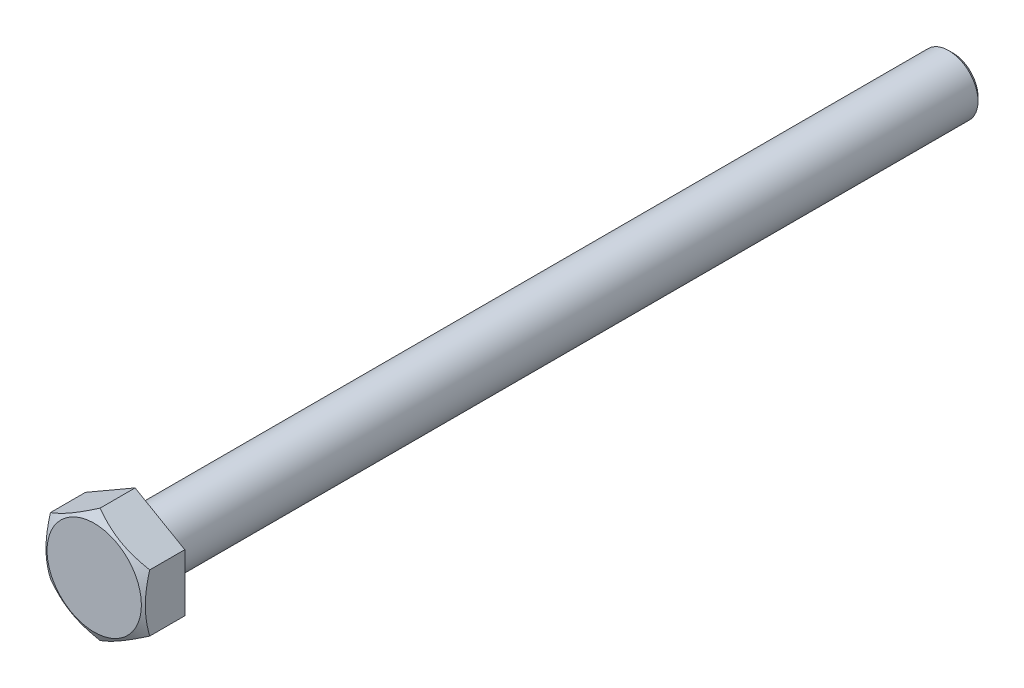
ISO-10303-21;
HEADER;
FILE_DESCRIPTION(('STEP AP214'),'2;1');
FILE_NAME('part.step','',(''),(''),'','','');
FILE_SCHEMA(('AUTOMOTIVE_DESIGN { 1 0 10303 214 1 1 1 1 }'));
ENDSEC;
DATA;
#1=APPLICATION_CONTEXT('core data for automotive mechanical design processes');
#2=APPLICATION_PROTOCOL_DEFINITION('international standard','automotive_design',2000,#1);
#3=PRODUCT_CONTEXT('',#1,'mechanical');
#4=PRODUCT('Part','Part','',(#3));
#5=PRODUCT_RELATED_PRODUCT_CATEGORY('part','',(#4));
#6=PRODUCT_DEFINITION_FORMATION('','',#4);
#7=PRODUCT_DEFINITION_CONTEXT('part definition',#1,'design');
#8=PRODUCT_DEFINITION('design','',#6,#7);
#9=PRODUCT_DEFINITION_SHAPE('','',#8);
#10=(LENGTH_UNIT() NAMED_UNIT(*) SI_UNIT(.MILLI.,.METRE.));
#11=(NAMED_UNIT(*) PLANE_ANGLE_UNIT() SI_UNIT($,.RADIAN.));
#12=(NAMED_UNIT(*) SI_UNIT($,.STERADIAN.) SOLID_ANGLE_UNIT());
#13=UNCERTAINTY_MEASURE_WITH_UNIT(LENGTH_MEASURE(1.E-05),#10,'distance_accuracy_value','');
#14=(GEOMETRIC_REPRESENTATION_CONTEXT(3) GLOBAL_UNCERTAINTY_ASSIGNED_CONTEXT((#13)) GLOBAL_UNIT_ASSIGNED_CONTEXT((#10,
#11,#12)) REPRESENTATION_CONTEXT('',''));
#15=CARTESIAN_POINT('',(0.,0.,0.));
#16=DIRECTION('',(0.,0.,1.));
#17=DIRECTION('',(1.,0.,0.));
#18=AXIS2_PLACEMENT_3D('',#15,#16,#17);
#19=CARTESIAN_POINT('',(8.50000000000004,-4.90747728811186,-0.001000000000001));
#20=DIRECTION('',(-0.499999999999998,0.866025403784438,0.));
#21=DIRECTION('',(-0.866025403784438,-0.499999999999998,0.));
#22=AXIS2_PLACEMENT_3D('',#19,#20,#21);
#23=PLANE('',#22);
#24=CARTESIAN_POINT('',(-0.00019999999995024,-9.81507004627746,5.99537008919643));
#25=CARTESIAN_POINT('',(0.186639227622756,-9.70719836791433,6.05763999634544));
#26=CARTESIAN_POINT('',(0.374175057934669,-9.59892450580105,6.11708383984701));
#27=CARTESIAN_POINT('',(0.75076975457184,-9.3814974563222,6.22954102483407));
#28=CARTESIAN_POINT('',(0.939829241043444,-9.27234391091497,6.28255159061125));
#29=CARTESIAN_POINT('',(1.51003475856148,-8.94313560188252,6.43089274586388));
#30=CARTESIAN_POINT('',(1.89343164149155,-8.72178130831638,6.51526720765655));
#31=CARTESIAN_POINT('',(2.46717766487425,-8.3905288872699,6.61420611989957));
#32=CARTESIAN_POINT('',(2.65581276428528,-8.28162036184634,6.64239093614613));
#33=CARTESIAN_POINT('',(3.03393602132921,-8.06331079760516,6.68965205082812));
#34=CARTESIAN_POINT('',(3.22342410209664,-7.95390980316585,6.70872915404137));
#35=CARTESIAN_POINT('',(3.60272652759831,-7.73491944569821,6.73729136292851));
#36=CARTESIAN_POINT('',(3.79254025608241,-7.62533043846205,6.74678735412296));
#37=CARTESIAN_POINT('',(4.17234305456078,-7.40605119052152,6.75598375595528));
#38=CARTESIAN_POINT('',(4.36233211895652,-7.29636095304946,6.75568446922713));
#39=CARTESIAN_POINT('',(4.71752301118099,-7.09129139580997,6.74597166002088));
#40=CARTESIAN_POINT('',(4.88274990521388,-6.99589760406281,6.73774296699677));
#41=CARTESIAN_POINT('',(5.21281671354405,-6.80533344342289,6.71403689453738));
#42=CARTESIAN_POINT('',(5.37765660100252,-6.71016309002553,6.6985590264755));
#43=CARTESIAN_POINT('',(5.87153810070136,-6.42502047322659,6.64161751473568));
#44=CARTESIAN_POINT('',(6.19970550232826,-6.23555293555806,6.58965307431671));
#45=CARTESIAN_POINT('',(6.8595214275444,-5.85460803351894,6.45974119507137));
#46=CARTESIAN_POINT('',(7.19108574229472,-5.66317928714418,6.38124306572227));
#47=CARTESIAN_POINT('',(7.84926989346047,-5.28317649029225,6.20308479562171));
#48=CARTESIAN_POINT('',(8.17589815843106,-5.09459757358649,6.10346649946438));
#49=CARTESIAN_POINT('',(8.50019999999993,-4.9073618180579,5.99537008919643));
#50=B_SPLINE_CURVE_WITH_KNOTS('',3,(#24,#25,#26,#27,#28,#29,#30,#31,#32,#33,#34,#35,#36,#37,#38,
#39,#40,#41,#42,#43,#44,#45,#46,#47,#48,#49),.UNSPECIFIED.,.F.,.F.,(4,2,2,2,2,2,2,2,2,2,2,2,4),
(0.,0.673596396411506,1.34748239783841,2.69805431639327,3.35679995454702,4.01548737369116,
4.67342558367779,5.33134346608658,5.9040955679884,6.47688628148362,7.6232836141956,
8.79510569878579,9.9646274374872),.UNSPECIFIED.);
#51=CARTESIAN_POINT('',(0.,-9.81495457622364,5.99543675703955));
#52=VERTEX_POINT('',#51);
#53=CARTESIAN_POINT('',(8.50000000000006,-4.90747728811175,5.99543675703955));
#54=VERTEX_POINT('',#53);
#55=EDGE_CURVE('E49',#52,#54,#50,.T.);
#56=ORIENTED_EDGE('',*,*,#55,.F.);
#57=DIRECTION('',(0.,0.,0.999999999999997));
#58=VECTOR('',#57,1.);
#59=CARTESIAN_POINT('',(0.,-9.81495457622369,-0.001000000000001));
#60=LINE('',#59,#58);
#61=CARTESIAN_POINT('',(0.,-9.81495457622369,0.));
#62=VERTEX_POINT('',#61);
#63=EDGE_CURVE('E120',#62,#52,#60,.T.);
#64=ORIENTED_EDGE('',*,*,#63,.F.);
#65=DIRECTION('',(0.866025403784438,0.499999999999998,0.));
#66=VECTOR('',#65,1.);
#67=CARTESIAN_POINT('',(8.50000000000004,-4.90747728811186,0.));
#68=LINE('',#67,#66);
#69=CARTESIAN_POINT('',(8.50000000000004,-4.90747728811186,0.));
#70=VERTEX_POINT('',#69);
#71=EDGE_CURVE('E57',#62,#70,#68,.T.);
#72=ORIENTED_EDGE('',*,*,#71,.T.);
#73=DIRECTION('',(0.,0.,0.999999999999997));
#74=VECTOR('',#73,1.);
#75=CARTESIAN_POINT('',(8.50000000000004,-4.90747728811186,-0.001000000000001));
#76=LINE('',#75,#74);
#77=EDGE_CURVE('E108',#70,#54,#76,.T.);
#78=ORIENTED_EDGE('',*,*,#77,.T.);
#79=EDGE_LOOP('',(#56,#64,#72,#78));
#80=FACE_BOUND('',#79,.T.);
#81=ADVANCED_FACE('F34',(#80),#23,.F.);
#82=CARTESIAN_POINT('',(-8.49999999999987,-4.90747728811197,-0.001000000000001));
#83=DIRECTION('',(-0.499999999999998,-0.866025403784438,0.));
#84=DIRECTION('',(0.866025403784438,-0.499999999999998,0.));
#85=AXIS2_PLACEMENT_3D('',#82,#83,#84);
#86=PLANE('',#85);
#87=ORIENTED_EDGE('',*,*,#63,.T.);
#88=CARTESIAN_POINT('',(0.000200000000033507,-9.81507004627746,5.99537008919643));
#89=CARTESIAN_POINT('',(-0.186639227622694,-9.70719836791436,6.05763999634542));
#90=CARTESIAN_POINT('',(-0.374175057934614,-9.5989245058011,6.11708383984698));
#91=CARTESIAN_POINT('',(-0.750769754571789,-9.38149745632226,6.22954102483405));
#92=CARTESIAN_POINT('',(-0.939829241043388,-9.27234391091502,6.28255159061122));
#93=CARTESIAN_POINT('',(-1.51003475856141,-8.94313560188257,6.43089274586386));
#94=CARTESIAN_POINT('',(-1.89343164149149,-8.72178130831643,6.51526720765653));
#95=CARTESIAN_POINT('',(-2.46717766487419,-8.39052888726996,6.61420611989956));
#96=CARTESIAN_POINT('',(-2.65581276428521,-8.28162036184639,6.64239093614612));
#97=CARTESIAN_POINT('',(-3.03393602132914,-8.06331079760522,6.68965205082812));
#98=CARTESIAN_POINT('',(-3.22342410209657,-7.95390980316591,6.70872915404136));
#99=CARTESIAN_POINT('',(-3.60272652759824,-7.73491944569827,6.73729136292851));
#100=CARTESIAN_POINT('',(-3.79254025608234,-7.62533043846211,6.74678735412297));
#101=CARTESIAN_POINT('',(-4.1723430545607,-7.40605119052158,6.75598375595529));
#102=CARTESIAN_POINT('',(-4.36233211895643,-7.29636095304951,6.75568446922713));
#103=CARTESIAN_POINT('',(-4.71752301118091,-7.09129139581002,6.74597166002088));
#104=CARTESIAN_POINT('',(-4.88274990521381,-6.99589760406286,6.73774296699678));
#105=CARTESIAN_POINT('',(-5.21281671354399,-6.80533344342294,6.7140368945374));
#106=CARTESIAN_POINT('',(-5.37765660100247,-6.71016309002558,6.69855902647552));
#107=CARTESIAN_POINT('',(-5.87153810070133,-6.42502047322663,6.6416175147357));
#108=CARTESIAN_POINT('',(-6.19970550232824,-6.23555293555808,6.58965307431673));
#109=CARTESIAN_POINT('',(-6.85952142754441,-5.85460803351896,6.45974119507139));
#110=CARTESIAN_POINT('',(-7.19108574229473,-5.66317928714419,6.38124306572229));
#111=CARTESIAN_POINT('',(-7.84926989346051,-5.28317649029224,6.20308479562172));
#112=CARTESIAN_POINT('',(-8.17589815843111,-5.09459757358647,6.10346649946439));
#113=CARTESIAN_POINT('',(-8.50019999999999,-4.90736181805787,5.99537008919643));
#114=B_SPLINE_CURVE_WITH_KNOTS('',3,(#88,#89,#90,#91,#92,#93,#94,#95,#96,#97,#98,#99,#100,#101,
#102,#103,#104,#105,#106,#107,#108,#109,#110,#111,#112,#113),.UNSPECIFIED.,.F.,.F.,(4,2,2,2,2,2,
2,2,2,2,2,2,4),(0.,0.673596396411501,1.34748239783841,2.69805431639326,3.356799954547,
4.01548737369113,4.67342558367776,5.33134346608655,5.90409556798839,6.47688628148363,
7.62328361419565,8.79510569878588,9.96462743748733),.UNSPECIFIED.);
#115=CARTESIAN_POINT('',(-8.49999999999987,-4.90747728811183,5.99543675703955));
#116=VERTEX_POINT('',#115);
#117=EDGE_CURVE('E161',#52,#116,#114,.T.);
#118=ORIENTED_EDGE('',*,*,#117,.T.);
#119=DIRECTION('',(0.,0.,0.999999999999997));
#120=VECTOR('',#119,1.);
#121=CARTESIAN_POINT('',(-8.49999999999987,-4.90747728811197,-0.001000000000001));
#122=LINE('',#121,#120);
#123=CARTESIAN_POINT('',(-8.49999999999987,-4.90747728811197,0.));
#124=VERTEX_POINT('',#123);
#125=EDGE_CURVE('E117',#124,#116,#122,.T.);
#126=ORIENTED_EDGE('',*,*,#125,.F.);
#127=DIRECTION('',(-0.866025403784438,0.499999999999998,0.));
#128=VECTOR('',#127,1.);
#129=CARTESIAN_POINT('',(-8.49999999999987,-4.90747728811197,0.));
#130=LINE('',#129,#128);
#131=EDGE_CURVE('E218',#62,#124,#130,.T.);
#132=ORIENTED_EDGE('',*,*,#131,.F.);
#133=EDGE_LOOP('',(#87,#118,#126,#132));
#134=FACE_BOUND('',#133,.T.);
#135=ADVANCED_FACE('F139',(#134),#86,.T.);
#136=CARTESIAN_POINT('',(-8.49999999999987,-4.90747728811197,-0.001000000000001));
#137=DIRECTION('',(0.999999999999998,0.,0.));
#138=DIRECTION('',(0.,0.,-0.999999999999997));
#139=AXIS2_PLACEMENT_3D('',#136,#137,#138);
#140=PLANE('',#139);
#141=CARTESIAN_POINT('',(-8.50000000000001,-13.3300385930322,2.53449094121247));
#142=CARTESIAN_POINT('',(-8.49999999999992,-12.9574590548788,2.71581539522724));
#143=CARTESIAN_POINT('',(-8.49999999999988,-12.58403984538,2.89544329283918));
#144=CARTESIAN_POINT('',(-8.49999999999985,-11.8350759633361,3.25035446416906));
#145=CARTESIAN_POINT('',(-8.49999999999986,-11.4595309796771,3.42563708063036));
#146=CARTESIAN_POINT('',(-8.49999999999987,-10.7040053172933,3.77175626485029));
#147=CARTESIAN_POINT('',(-8.49999999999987,-10.3240117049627,3.94256469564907));
#148=CARTESIAN_POINT('',(-8.49999999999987,-9.56105283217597,4.27738456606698));
#149=CARTESIAN_POINT('',(-8.49999999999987,-9.17808770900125,4.44139631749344));
#150=CARTESIAN_POINT('',(-8.49999999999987,-8.39578771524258,4.76614171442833));
#151=CARTESIAN_POINT('',(-8.49999999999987,-7.99633177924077,4.92658529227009));
#152=CARTESIAN_POINT('',(-8.49999999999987,-7.19280284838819,5.23568387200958));
#153=CARTESIAN_POINT('',(-8.49999999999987,-6.78872934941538,5.38433757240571));
#154=CARTESIAN_POINT('',(-8.49999999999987,-5.97602651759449,5.66606258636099));
#155=CARTESIAN_POINT('',(-8.49999999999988,-5.56740779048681,5.79916417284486));
#156=CARTESIAN_POINT('',(-8.49999999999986,-4.74432557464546,6.04561404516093));
#157=CARTESIAN_POINT('',(-8.49999999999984,-4.32986392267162,6.15896839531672));
#158=CARTESIAN_POINT('',(-8.49999999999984,-3.4970559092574,6.35998254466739));
#159=CARTESIAN_POINT('',(-8.49999999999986,-3.07874445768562,6.44778313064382));
#160=CARTESIAN_POINT('',(-8.49999999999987,-2.4473530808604,6.55657967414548));
#161=CARTESIAN_POINT('',(-8.49999999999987,-2.23622125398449,6.58902917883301));
#162=CARTESIAN_POINT('',(-8.49999999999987,-1.81285861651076,6.64566086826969));
#163=CARTESIAN_POINT('',(-8.49999999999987,-1.6006279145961,6.66984385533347));
#164=CARTESIAN_POINT('',(-8.49999999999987,-1.17819018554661,6.70914936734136));
#165=CARTESIAN_POINT('',(-8.49999999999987,-0.967994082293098,6.72438880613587));
#166=CARTESIAN_POINT('',(-8.49999999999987,-0.547145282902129,6.74595843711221));
#167=CARTESIAN_POINT('',(-8.49999999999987,-0.336492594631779,6.7522887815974));
#168=CARTESIAN_POINT('',(-8.49999999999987,0.084893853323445,6.75588862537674));
#169=CARTESIAN_POINT('',(-8.49999999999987,0.295627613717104,6.75315804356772));
#170=CARTESIAN_POINT('',(-8.49999999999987,0.716788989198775,6.73870443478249));
#171=CARTESIAN_POINT('',(-8.49999999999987,0.92721658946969,6.72698098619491));
#172=CARTESIAN_POINT('',(-8.49999999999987,1.42840873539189,6.6886003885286));
#173=CARTESIAN_POINT('',(-8.49999999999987,1.71887274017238,6.65792861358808));
#174=CARTESIAN_POINT('',(-8.49999999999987,2.29772833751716,6.58108968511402));
#175=CARTESIAN_POINT('',(-8.49999999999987,2.58611966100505,6.53492055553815));
#176=CARTESIAN_POINT('',(-8.49999999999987,3.44779761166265,6.37560864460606));
#177=CARTESIAN_POINT('',(-8.49999999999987,4.0172979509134,6.24168658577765));
#178=CARTESIAN_POINT('',(-8.49999999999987,4.86928176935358,6.00833364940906));
#179=CARTESIAN_POINT('',(-8.49999999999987,5.15615049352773,5.92398381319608));
#180=CARTESIAN_POINT('',(-8.49999999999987,5.72710339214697,5.74625067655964));
#181=CARTESIAN_POINT('',(-8.49999999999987,6.01118754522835,5.65286730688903));
#182=CARTESIAN_POINT('',(-8.49999999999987,6.5766593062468,5.45858816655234));
#183=CARTESIAN_POINT('',(-8.49999999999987,6.85804767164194,5.35769458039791));
#184=CARTESIAN_POINT('',(-8.49999999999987,7.41847111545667,5.14960951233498));
#185=CARTESIAN_POINT('',(-8.49999999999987,7.69750624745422,5.04241817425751));
#186=CARTESIAN_POINT('',(-8.49999999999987,8.44980890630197,4.7452330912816));
#187=CARTESIAN_POINT('',(-8.49999999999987,8.92109165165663,4.55021974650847));
#188=CARTESIAN_POINT('',(-8.49999999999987,9.85881492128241,4.14883877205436));
#189=CARTESIAN_POINT('',(-8.49999999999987,10.3252549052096,3.94246989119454));
#190=CARTESIAN_POINT('',(-8.49999999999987,11.2544088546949,3.52107400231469));
#191=CARTESIAN_POINT('',(-8.49999999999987,11.7171213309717,3.30604372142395));
#192=CARTESIAN_POINT('',(-8.49999999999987,12.6393972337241,2.86940227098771));
#193=CARTESIAN_POINT('',(-8.49999999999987,13.0989607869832,2.64779136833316));
#194=CARTESIAN_POINT('',(-8.49999999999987,14.0162966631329,2.19906730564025));
#195=CARTESIAN_POINT('',(-8.49999999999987,14.4740649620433,1.97194593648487));
#196=CARTESIAN_POINT('',(-8.49999999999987,15.3875498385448,1.5136114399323));
#197=CARTESIAN_POINT('',(-8.49999999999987,15.8432663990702,1.28239827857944));
#198=CARTESIAN_POINT('',(-8.49999999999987,16.7529150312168,0.816736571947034));
#199=CARTESIAN_POINT('',(-8.49999999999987,17.2068474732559,0.582288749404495));
#200=CARTESIAN_POINT('',(-8.49999999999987,18.1133194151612,0.11071405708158));
#201=CARTESIAN_POINT('',(-8.49999999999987,18.5658589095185,-0.126412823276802));
#202=CARTESIAN_POINT('',(-8.49999999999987,19.8259423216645,-0.790591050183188));
#203=CARTESIAN_POINT('',(-8.49999999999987,20.6322150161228,-1.2200536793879));
#204=CARTESIAN_POINT('',(-8.49999999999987,22.2420810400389,-2.0840781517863));
#205=CARTESIAN_POINT('',(-8.49999999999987,23.0456742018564,-2.51864030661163));
#206=CARTESIAN_POINT('',(-8.49999999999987,24.6481263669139,-3.39011718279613));
#207=CARTESIAN_POINT('',(-8.49999999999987,25.4469922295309,-3.82701929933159));
#208=CARTESIAN_POINT('',(-8.49999999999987,26.6440649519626,-4.48452860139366));
#209=CARTESIAN_POINT('',(-8.49999999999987,27.0428694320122,-4.704049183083));
#210=CARTESIAN_POINT('',(-8.49999999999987,27.8401226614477,-5.14373426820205));
#211=CARTESIAN_POINT('',(-8.49999999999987,28.2385714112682,-5.36389877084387));
#212=CARTESIAN_POINT('',(-8.49999999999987,28.6368640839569,-5.58434533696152));
#213=B_SPLINE_CURVE_WITH_KNOTS('',3,(#141,#142,#143,#144,#145,#146,#147,#148,#149,#150,#151,
#152,#153,#154,#155,#156,#157,#158,#159,#160,#161,#162,#163,#164,#165,#166,#167,#168,#169,#170,
#171,#172,#173,#174,#175,#176,#177,#178,#179,#180,#181,#182,#183,#184,#185,#186,#187,#188,#189,
#190,#191,#192,#193,#194,#195,#196,#197,#198,#199,#200,#201,#202,#203,#204,#205,#206,#207,#208,
#209,#210,#211,#212),.UNSPECIFIED.,.F.,.F.,(4,2,2,2,2,2,2,2,2,2,2,2,2,2,2,2,2,2,2,2,2,2,2,2,2,2,
2,2,2,2,2,2,2,2,2,4),(0.,1.24309397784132,2.4863748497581,3.73617582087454,4.98591939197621,
6.27719450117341,7.56861195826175,8.85747218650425,10.1459359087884,11.4271603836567,
12.0678568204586,12.7084910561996,13.3405525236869,13.9726031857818,14.6046595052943,
15.2367454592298,16.112490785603,16.9883478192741,18.7409320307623,19.6378908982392,
20.534856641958,21.4315624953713,22.3282478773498,23.8581353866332,25.388191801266,
26.9188319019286,28.4494100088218,29.9824283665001,31.5154594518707,33.048153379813,
34.5808533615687,37.3213766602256,40.0620683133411,42.7936585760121,44.159347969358,
45.5250356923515),.UNSPECIFIED.);
#214=CARTESIAN_POINT('',(-8.49999999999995,4.90747728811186,5.99543675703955));
#215=VERTEX_POINT('',#214);
#216=EDGE_CURVE('E192',#215,#116,#213,.F.);
#217=ORIENTED_EDGE('',*,*,#216,.F.);
#218=DIRECTION('',(0.,0.,0.999999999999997));
#219=VECTOR('',#218,1.);
#220=CARTESIAN_POINT('',(-8.49999999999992,4.90747728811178,-0.001000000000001));
#221=LINE('',#220,#219);
#222=CARTESIAN_POINT('',(-8.49999999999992,4.90747728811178,0.));
#223=VERTEX_POINT('',#222);
#224=EDGE_CURVE('E110',#223,#215,#221,.T.);
#225=ORIENTED_EDGE('',*,*,#224,.F.);
#226=DIRECTION('',(0.,-0.999999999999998,0.));
#227=VECTOR('',#226,1.);
#228=CARTESIAN_POINT('',(-8.49999999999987,-4.90747728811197,0.));
#229=LINE('',#228,#227);
#230=EDGE_CURVE('E219',#223,#124,#229,.T.);
#231=ORIENTED_EDGE('',*,*,#230,.T.);
#232=ORIENTED_EDGE('',*,*,#125,.T.);
#233=EDGE_LOOP('',(#217,#225,#231,#232));
#234=FACE_BOUND('',#233,.T.);
#235=ADVANCED_FACE('F145',(#234),#140,.F.);
#236=CARTESIAN_POINT('',(-8.49999999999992,4.90747728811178,-0.001000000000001));
#237=DIRECTION('',(0.499999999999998,-0.866025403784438,0.));
#238=DIRECTION('',(0.866025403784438,0.499999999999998,0.));
#239=AXIS2_PLACEMENT_3D('',#236,#237,#238);
#240=PLANE('',#239);
#241=CARTESIAN_POINT('',(0.000200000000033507,9.81507004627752,5.99537008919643));
#242=CARTESIAN_POINT('',(-0.186639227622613,9.70719836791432,6.05763999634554));
#243=CARTESIAN_POINT('',(-0.374175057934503,9.59892450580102,6.11708383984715));
#244=CARTESIAN_POINT('',(-0.750769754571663,9.38149745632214,6.22954102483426));
#245=CARTESIAN_POINT('',(-0.939829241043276,9.27234391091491,6.28255159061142));
#246=CARTESIAN_POINT('',(-1.51003475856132,8.94313560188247,6.43089274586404));
#247=CARTESIAN_POINT('',(-1.89343164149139,8.72178130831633,6.51526720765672));
#248=CARTESIAN_POINT('',(-2.46717766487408,8.39052888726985,6.61420611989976));
#249=CARTESIAN_POINT('',(-2.65581276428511,8.28162036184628,6.64239093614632));
#250=CARTESIAN_POINT('',(-3.03393602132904,8.06331079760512,6.68965205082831));
#251=CARTESIAN_POINT('',(-3.22342410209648,7.95390980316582,6.70872915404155));
#252=CARTESIAN_POINT('',(-3.60272652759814,7.73491944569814,6.73729136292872));
#253=CARTESIAN_POINT('',(-3.79254025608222,7.62533043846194,6.74678735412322));
#254=CARTESIAN_POINT('',(-4.17234305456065,7.40605119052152,6.75598375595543));
#255=CARTESIAN_POINT('',(-4.36233211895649,7.29636095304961,6.75568446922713));
#256=CARTESIAN_POINT('',(-4.71752301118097,7.09129139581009,6.7459716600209));
#257=CARTESIAN_POINT('',(-4.88274990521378,6.99589760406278,6.73774296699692));
#258=CARTESIAN_POINT('',(-5.2128167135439,6.80533344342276,6.71403689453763));
#259=CARTESIAN_POINT('',(-5.3776566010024,6.71016309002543,6.69855902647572));
#260=CARTESIAN_POINT('',(-5.87153810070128,6.42502047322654,6.64161751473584));
#261=CARTESIAN_POINT('',(-6.19970550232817,6.23555293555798,6.58965307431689));
#262=CARTESIAN_POINT('',(-6.8595214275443,5.85460803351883,6.45974119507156));
#263=CARTESIAN_POINT('',(-7.19108574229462,5.66317928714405,6.38124306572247));
#264=CARTESIAN_POINT('',(-7.84926989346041,5.28317649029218,6.20308479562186));
#265=CARTESIAN_POINT('',(-8.17589815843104,5.09459757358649,6.10346649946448));
#266=CARTESIAN_POINT('',(-8.50019999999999,4.90736181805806,5.99537008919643));
#267=B_SPLINE_CURVE_WITH_KNOTS('',3,(#241,#242,#243,#244,#245,#246,#247,#248,#249,#250,#251,
#252,#253,#254,#255,#256,#257,#258,#259,#260,#261,#262,#263,#264,#265,#266),.UNSPECIFIED.,.F.,
.F.,(4,2,2,2,2,2,2,2,2,2,2,2,4),(0.,0.673596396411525,1.34748239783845,2.6980543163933,
3.35679995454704,4.01548737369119,4.67342558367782,5.33134346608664,5.90409556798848,
6.47688628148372,7.62328361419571,8.79510569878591,9.96462743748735),.UNSPECIFIED.);
#268=CARTESIAN_POINT('',(0.,9.81495457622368,5.99543675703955));
#269=VERTEX_POINT('',#268);
#270=EDGE_CURVE('E103',#269,#215,#267,.T.);
#271=ORIENTED_EDGE('',*,*,#270,.F.);
#272=DIRECTION('',(0.,0.,0.999999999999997));
#273=VECTOR('',#272,1.);
#274=CARTESIAN_POINT('',(0.,9.81495457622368,-0.001000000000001));
#275=LINE('',#274,#273);
#276=CARTESIAN_POINT('',(0.,9.81495457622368,0.));
#277=VERTEX_POINT('',#276);
#278=EDGE_CURVE('E102',#277,#269,#275,.T.);
#279=ORIENTED_EDGE('',*,*,#278,.F.);
#280=DIRECTION('',(-0.866025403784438,-0.499999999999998,0.));
#281=VECTOR('',#280,1.);
#282=CARTESIAN_POINT('',(-8.49999999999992,4.90747728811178,0.));
#283=LINE('',#282,#281);
#284=EDGE_CURVE('E223',#277,#223,#283,.T.);
#285=ORIENTED_EDGE('',*,*,#284,.T.);
#286=ORIENTED_EDGE('',*,*,#224,.T.);
#287=EDGE_LOOP('',(#271,#279,#285,#286));
#288=FACE_BOUND('',#287,.T.);
#289=ADVANCED_FACE('F198',(#288),#240,.F.);
#290=CARTESIAN_POINT('',(8.50000000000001,4.90747728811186,-0.001000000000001));
#291=DIRECTION('',(0.499999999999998,0.866025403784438,0.));
#292=DIRECTION('',(-0.866025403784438,0.499999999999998,0.));
#293=AXIS2_PLACEMENT_3D('',#290,#291,#292);
#294=PLANE('',#293);
#295=ORIENTED_EDGE('',*,*,#278,.T.);
#296=CARTESIAN_POINT('',(-0.000199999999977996,9.81507004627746,5.99537008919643));
#297=CARTESIAN_POINT('',(0.186639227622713,9.70719836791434,6.05763999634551));
#298=CARTESIAN_POINT('',(0.37417505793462,9.59892450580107,6.11708383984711));
#299=CARTESIAN_POINT('',(0.750769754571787,9.38149745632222,6.22954102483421));
#300=CARTESIAN_POINT('',(0.939829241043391,9.27234391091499,6.28255159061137));
#301=CARTESIAN_POINT('',(1.51003475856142,8.94313560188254,6.43089274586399));
#302=CARTESIAN_POINT('',(1.89343164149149,8.72178130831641,6.51526720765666));
#303=CARTESIAN_POINT('',(2.46717766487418,8.39052888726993,6.61420611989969));
#304=CARTESIAN_POINT('',(2.6558127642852,8.28162036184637,6.64239093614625));
#305=CARTESIAN_POINT('',(3.03393602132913,8.0633107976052,6.68965205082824));
#306=CARTESIAN_POINT('',(3.22342410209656,7.9539098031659,6.70872915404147));
#307=CARTESIAN_POINT('',(3.60272652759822,7.73491944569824,6.73729136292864));
#308=CARTESIAN_POINT('',(3.79254025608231,7.62533043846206,6.74678735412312));
#309=CARTESIAN_POINT('',(4.1723430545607,7.40605119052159,6.75598375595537));
#310=CARTESIAN_POINT('',(4.36233211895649,7.2963609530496,6.75568446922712));
#311=CARTESIAN_POINT('',(4.71752301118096,7.0912913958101,6.74597166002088));
#312=CARTESIAN_POINT('',(4.88274990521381,6.99589760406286,6.73774296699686));
#313=CARTESIAN_POINT('',(5.21281671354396,6.80533344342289,6.71403689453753));
#314=CARTESIAN_POINT('',(5.37765660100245,6.71016309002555,6.69855902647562));
#315=CARTESIAN_POINT('',(5.87153810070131,6.42502047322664,6.64161751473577));
#316=CARTESIAN_POINT('',(6.1997055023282,6.23555293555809,6.58965307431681));
#317=CARTESIAN_POINT('',(6.85952142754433,5.85460803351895,6.45974119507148));
#318=CARTESIAN_POINT('',(7.19108574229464,5.66317928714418,6.38124306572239));
#319=CARTESIAN_POINT('',(7.84926989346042,5.28317649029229,6.20308479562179));
#320=CARTESIAN_POINT('',(8.17589815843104,5.0945975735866,6.10346649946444));
#321=CARTESIAN_POINT('',(8.50019999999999,4.90736181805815,5.99537008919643));
#322=B_SPLINE_CURVE_WITH_KNOTS('',3,(#296,#297,#298,#299,#300,#301,#302,#303,#304,#305,#306,
#307,#308,#309,#310,#311,#312,#313,#314,#315,#316,#317,#318,#319,#320,#321),.UNSPECIFIED.,.F.,
.F.,(4,2,2,2,2,2,2,2,2,2,2,2,4),(0.,0.67359639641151,1.34748239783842,2.69805431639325,
3.35679995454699,4.01548737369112,4.67342558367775,5.33134346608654,5.90409556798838,
6.4768862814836,7.62328361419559,8.79510569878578,9.9646274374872),.UNSPECIFIED.);
#323=CARTESIAN_POINT('',(8.50000000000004,4.90747728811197,5.99543675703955));
#324=VERTEX_POINT('',#323);
#325=EDGE_CURVE('E87',#269,#324,#322,.T.);
#326=ORIENTED_EDGE('',*,*,#325,.T.);
#327=DIRECTION('',(0.,0.,0.999999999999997));
#328=VECTOR('',#327,1.);
#329=CARTESIAN_POINT('',(8.50000000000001,4.90747728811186,-0.001000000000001));
#330=LINE('',#329,#328);
#331=CARTESIAN_POINT('',(8.50000000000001,4.90747728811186,0.));
#332=VERTEX_POINT('',#331);
#333=EDGE_CURVE('E100',#332,#324,#330,.T.);
#334=ORIENTED_EDGE('',*,*,#333,.F.);
#335=DIRECTION('',(0.866025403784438,-0.499999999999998,0.));
#336=VECTOR('',#335,1.);
#337=CARTESIAN_POINT('',(8.50000000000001,4.90747728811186,0.));
#338=LINE('',#337,#336);
#339=EDGE_CURVE('E160',#277,#332,#338,.T.);
#340=ORIENTED_EDGE('',*,*,#339,.F.);
#341=EDGE_LOOP('',(#295,#326,#334,#340));
#342=FACE_BOUND('',#341,.T.);
#343=ADVANCED_FACE('F98',(#342),#294,.T.);
#344=CARTESIAN_POINT('',(8.50000000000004,-4.90747728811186,-0.001000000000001));
#345=DIRECTION('',(0.999999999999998,0.,0.));
#346=DIRECTION('',(0.,0.,-0.999999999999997));
#347=AXIS2_PLACEMENT_3D('',#344,#345,#346);
#348=PLANE('',#347);
#349=ORIENTED_EDGE('',*,*,#333,.T.);
#350=CARTESIAN_POINT('',(8.50000000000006,-13.330038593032,2.53449094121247));
#351=CARTESIAN_POINT('',(8.50000000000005,-12.9574590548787,2.71581539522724));
#352=CARTESIAN_POINT('',(8.50000000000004,-12.5840398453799,2.89544329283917));
#353=CARTESIAN_POINT('',(8.50000000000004,-11.835075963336,3.25035446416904));
#354=CARTESIAN_POINT('',(8.50000000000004,-11.459530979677,3.42563708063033));
#355=CARTESIAN_POINT('',(8.50000000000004,-10.7040053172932,3.77175626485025));
#356=CARTESIAN_POINT('',(8.50000000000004,-10.3240117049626,3.94256469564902));
#357=CARTESIAN_POINT('',(8.50000000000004,-9.5610528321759,4.27738456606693));
#358=CARTESIAN_POINT('',(8.50000000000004,-9.17808770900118,4.44139631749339));
#359=CARTESIAN_POINT('',(8.50000000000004,-8.39578771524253,4.76614171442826));
#360=CARTESIAN_POINT('',(8.50000000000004,-7.99633177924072,4.92658529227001));
#361=CARTESIAN_POINT('',(8.50000000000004,-7.19280284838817,5.2356838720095));
#362=CARTESIAN_POINT('',(8.50000000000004,-6.78872934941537,5.38433757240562));
#363=CARTESIAN_POINT('',(8.50000000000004,-5.97602651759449,5.66606258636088));
#364=CARTESIAN_POINT('',(8.50000000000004,-5.56740779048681,5.79916417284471));
#365=CARTESIAN_POINT('',(8.50000000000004,-4.74432557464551,6.04561404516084));
#366=CARTESIAN_POINT('',(8.50000000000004,-4.32986392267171,6.15896839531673));
#367=CARTESIAN_POINT('',(8.50000000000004,-3.49705590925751,6.35998254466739));
#368=CARTESIAN_POINT('',(8.50000000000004,-3.07874445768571,6.44778313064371));
#369=CARTESIAN_POINT('',(8.50000000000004,-2.44735308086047,6.55657967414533));
#370=CARTESIAN_POINT('',(8.50000000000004,-2.23622125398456,6.58902917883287));
#371=CARTESIAN_POINT('',(8.50000000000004,-1.81285861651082,6.64566086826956));
#372=CARTESIAN_POINT('',(8.50000000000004,-1.60062791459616,6.66984385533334));
#373=CARTESIAN_POINT('',(8.50000000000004,-1.17819018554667,6.70914936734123));
#374=CARTESIAN_POINT('',(8.50000000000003,-0.967994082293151,6.72438880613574));
#375=CARTESIAN_POINT('',(8.50000000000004,-0.547145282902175,6.74595843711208));
#376=CARTESIAN_POINT('',(8.50000000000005,-0.336492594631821,6.75228878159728));
#377=CARTESIAN_POINT('',(8.50000000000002,0.0848938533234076,6.7558886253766));
#378=CARTESIAN_POINT('',(8.49999999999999,0.295627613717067,6.75315804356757));
#379=CARTESIAN_POINT('',(8.50000000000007,0.716788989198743,6.73870443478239));
#380=CARTESIAN_POINT('',(8.50000000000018,0.927216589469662,6.72698098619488));
#381=CARTESIAN_POINT('',(8.50000000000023,1.42840873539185,6.6886003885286));
#382=CARTESIAN_POINT('',(8.50000000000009,1.71887274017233,6.65792861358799));
#383=CARTESIAN_POINT('',(8.49999999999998,2.29772833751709,6.58108968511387));
#384=CARTESIAN_POINT('',(8.50000000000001,2.58611966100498,6.53492055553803));
#385=CARTESIAN_POINT('',(8.50000000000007,3.44779761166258,6.37560864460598));
#386=CARTESIAN_POINT('',(8.50000000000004,4.01729795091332,6.24168658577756));
#387=CARTESIAN_POINT('',(8.50000000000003,4.8692817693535,6.00833364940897));
#388=CARTESIAN_POINT('',(8.50000000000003,5.15615049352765,5.92398381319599));
#389=CARTESIAN_POINT('',(8.50000000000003,5.72710339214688,5.74625067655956));
#390=CARTESIAN_POINT('',(8.50000000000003,6.01118754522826,5.65286730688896));
#391=CARTESIAN_POINT('',(8.50000000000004,6.57665930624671,5.45858816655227));
#392=CARTESIAN_POINT('',(8.50000000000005,6.85804767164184,5.35769458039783));
#393=CARTESIAN_POINT('',(8.50000000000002,7.41847111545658,5.14960951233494));
#394=CARTESIAN_POINT('',(8.49999999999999,7.69750624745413,5.0424181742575));
#395=CARTESIAN_POINT('',(8.49999999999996,8.4498089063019,4.74523309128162));
#396=CARTESIAN_POINT('',(8.50000000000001,8.92109165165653,4.55021974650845));
#397=CARTESIAN_POINT('',(8.50000000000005,9.85881492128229,4.14883877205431));
#398=CARTESIAN_POINT('',(8.50000000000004,10.3252549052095,3.9424698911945));
#399=CARTESIAN_POINT('',(8.50000000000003,11.2544088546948,3.52107400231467));
#400=CARTESIAN_POINT('',(8.50000000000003,11.7171213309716,3.30604372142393));
#401=CARTESIAN_POINT('',(8.50000000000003,12.639397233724,2.86940227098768));
#402=CARTESIAN_POINT('',(8.50000000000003,13.098960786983,2.64779136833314));
#403=CARTESIAN_POINT('',(8.50000000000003,14.0162966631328,2.19906730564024));
#404=CARTESIAN_POINT('',(8.50000000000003,14.4740649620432,1.97194593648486));
#405=CARTESIAN_POINT('',(8.50000000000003,15.3875498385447,1.51361143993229));
#406=CARTESIAN_POINT('',(8.50000000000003,15.8432663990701,1.28239827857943));
#407=CARTESIAN_POINT('',(8.50000000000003,16.7529150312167,0.816736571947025));
#408=CARTESIAN_POINT('',(8.50000000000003,17.2068474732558,0.582288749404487));
#409=CARTESIAN_POINT('',(8.50000000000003,18.1133194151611,0.110714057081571));
#410=CARTESIAN_POINT('',(8.50000000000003,18.5658589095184,-0.126412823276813));
#411=CARTESIAN_POINT('',(8.50000000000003,19.8259423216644,-0.790591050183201));
#412=CARTESIAN_POINT('',(8.50000000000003,20.6322150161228,-1.22005367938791));
#413=CARTESIAN_POINT('',(8.50000000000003,22.2420810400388,-2.08407815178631));
#414=CARTESIAN_POINT('',(8.50000000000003,23.0456742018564,-2.51864030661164));
#415=CARTESIAN_POINT('',(8.50000000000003,24.6481263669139,-3.39011718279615));
#416=CARTESIAN_POINT('',(8.50000000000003,25.4469922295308,-3.8270192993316));
#417=CARTESIAN_POINT('',(8.50000000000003,26.6440649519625,-4.48452860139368));
#418=CARTESIAN_POINT('',(8.50000000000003,27.0428694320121,-4.70404918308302));
#419=CARTESIAN_POINT('',(8.50000000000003,27.8401226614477,-5.14373426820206));
#420=CARTESIAN_POINT('',(8.50000000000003,28.2385714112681,-5.36389877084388));
#421=CARTESIAN_POINT('',(8.50000000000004,28.6368640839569,-5.58434533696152));
#422=B_SPLINE_CURVE_WITH_KNOTS('',3,(#350,#351,#352,#353,#354,#355,#356,#357,#358,#359,#360,
#361,#362,#363,#364,#365,#366,#367,#368,#369,#370,#371,#372,#373,#374,#375,#376,#377,#378,#379,
#380,#381,#382,#383,#384,#385,#386,#387,#388,#389,#390,#391,#392,#393,#394,#395,#396,#397,#398,
#399,#400,#401,#402,#403,#404,#405,#406,#407,#408,#409,#410,#411,#412,#413,#414,#415,#416,#417,
#418,#419,#420,#421),.UNSPECIFIED.,.F.,.F.,(4,2,2,2,2,2,2,2,2,2,2,2,2,2,2,2,2,2,2,2,2,2,2,2,2,2,
2,2,2,2,2,2,2,2,2,4),(0.,1.24309397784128,2.48637484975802,3.73617582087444,4.98591939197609,
6.27719450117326,7.56861195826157,8.85747218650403,10.1459359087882,11.4271603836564,
12.0678568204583,12.7084910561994,13.3405525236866,13.9726031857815,14.6046595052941,
15.2367454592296,16.1124907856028,16.9883478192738,18.740932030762,19.6378908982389,
20.5348566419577,21.431562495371,22.3282478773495,23.8581353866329,25.3881918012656,
26.9188319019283,28.4494100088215,29.9824283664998,31.5154594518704,33.0481533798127,
34.5808533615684,37.3213766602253,40.0620683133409,42.7936585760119,44.1593479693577,
45.5250356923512),.UNSPECIFIED.);
#423=EDGE_CURVE('E84',#324,#54,#422,.F.);
#424=ORIENTED_EDGE('',*,*,#423,.T.);
#425=ORIENTED_EDGE('',*,*,#77,.F.);
#426=DIRECTION('',(0.,-0.999999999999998,0.));
#427=VECTOR('',#426,1.);
#428=CARTESIAN_POINT('',(8.50000000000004,-4.90747728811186,0.));
#429=LINE('',#428,#427);
#430=EDGE_CURVE('E107',#332,#70,#429,.T.);
#431=ORIENTED_EDGE('',*,*,#430,.F.);
#432=EDGE_LOOP('',(#349,#424,#425,#431));
#433=FACE_BOUND('',#432,.T.);
#434=ADVANCED_FACE('F106',(#433),#348,.T.);
#435=CARTESIAN_POINT('',(0.,0.,0.));
#436=DIRECTION('',(0.,0.,0.999999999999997));
#437=DIRECTION('',(0.999999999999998,0.,0.));
#438=AXIS2_PLACEMENT_3D('',#435,#436,#437);
#439=PLANE('',#438);
#440=CARTESIAN_POINT('',(0.,0.,0.));
#441=DIRECTION('',(0.,0.,0.999999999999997));
#442=DIRECTION('',(0.999999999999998,0.,0.));
#443=AXIS2_PLACEMENT_3D('',#440,#441,#442);
#444=CIRCLE('',#443,5.);
#445=CARTESIAN_POINT('',(4.99999999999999,0.,0.));
#446=VERTEX_POINT('',#445);
#447=EDGE_CURVE('E216',#446,#446,#444,.T.);
#448=ORIENTED_EDGE('',*,*,#447,.T.);
#449=EDGE_LOOP('',(#448));
#450=FACE_BOUND('',#449,.T.);
#451=ORIENTED_EDGE('',*,*,#430,.T.);
#452=ORIENTED_EDGE('',*,*,#71,.F.);
#453=ORIENTED_EDGE('',*,*,#131,.T.);
#454=ORIENTED_EDGE('',*,*,#230,.F.);
#455=ORIENTED_EDGE('',*,*,#284,.F.);
#456=ORIENTED_EDGE('',*,*,#339,.T.);
#457=EDGE_LOOP('',(#451,#452,#453,#454,#455,#456));
#458=FACE_BOUND('',#457,.T.);
#459=ADVANCED_FACE('F171',(#450,#458),#439,.F.);
#460=CARTESIAN_POINT('',(0.,1.11022302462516E-13,6.99999999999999));
#461=DIRECTION('',(0.,0.,-0.999999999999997));
#462=DIRECTION('',(0.999999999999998,0.,0.));
#463=AXIS2_PLACEMENT_3D('',#460,#461,#462);
#464=CONICAL_SURFACE('',#463,8.075,1.0471975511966);
#465=CARTESIAN_POINT('',(0.,1.11022302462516E-13,6.99999999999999));
#466=DIRECTION('',(0.,0.,0.999999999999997));
#467=DIRECTION('',(0.999999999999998,0.,0.));
#468=AXIS2_PLACEMENT_3D('',#465,#466,#467);
#469=CIRCLE('',#468,8.075);
#470=CARTESIAN_POINT('',(8.07499999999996,1.12367060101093E-13,6.99999999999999));
#471=VERTEX_POINT('',#470);
#472=EDGE_CURVE('E93',#471,#471,#469,.T.);
#473=ORIENTED_EDGE('',*,*,#472,.F.);
#474=EDGE_LOOP('',(#473));
#475=FACE_BOUND('',#474,.T.);
#476=ORIENTED_EDGE('',*,*,#117,.F.);
#477=ORIENTED_EDGE('',*,*,#55,.T.);
#478=ORIENTED_EDGE('',*,*,#423,.F.);
#479=ORIENTED_EDGE('',*,*,#325,.F.);
#480=ORIENTED_EDGE('',*,*,#270,.T.);
#481=ORIENTED_EDGE('',*,*,#216,.T.);
#482=EDGE_LOOP('',(#476,#477,#478,#479,#480,#481));
#483=FACE_BOUND('',#482,.T.);
#484=ADVANCED_FACE('F86',(#475,#483),#464,.T.);
#485=CARTESIAN_POINT('',(0.,1.11022302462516E-13,6.99999999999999));
#486=DIRECTION('',(0.,0.,0.999999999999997));
#487=DIRECTION('',(0.999999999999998,0.,0.));
#488=AXIS2_PLACEMENT_3D('',#485,#486,#487);
#489=PLANE('',#488);
#490=ORIENTED_EDGE('',*,*,#472,.T.);
#491=EDGE_LOOP('',(#490));
#492=FACE_BOUND('',#491,.T.);
#493=ADVANCED_FACE('F152',(#492),#489,.T.);
#494=CARTESIAN_POINT('',(0.,0.,-140.));
#495=DIRECTION('',(0.,0.,0.999999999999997));
#496=DIRECTION('',(0.999999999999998,0.,0.));
#497=AXIS2_PLACEMENT_3D('',#494,#495,#496);
#498=CYLINDRICAL_SURFACE('',#497,5.);
#499=CARTESIAN_POINT('',(0.,0.,-139.3));
#500=DIRECTION('',(0.,0.,0.999999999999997));
#501=DIRECTION('',(0.999999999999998,0.,0.));
#502=AXIS2_PLACEMENT_3D('',#499,#500,#501);
#503=CIRCLE('',#502,5.);
#504=CARTESIAN_POINT('',(4.99999999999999,0.,-139.3));
#505=VERTEX_POINT('',#504);
#506=EDGE_CURVE('E42',#505,#505,#503,.T.);
#507=CARTESIAN_POINT('',(4.99999999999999,0.,-139.3));
#508=CARTESIAN_POINT('',(4.99999999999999,0.,-137.848958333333));
#509=CARTESIAN_POINT('',(4.99999999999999,0.,-136.397916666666));
#510=CARTESIAN_POINT('',(4.99999999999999,0.,-133.495833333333));
#511=CARTESIAN_POINT('',(4.99999999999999,0.,-132.044791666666));
#512=CARTESIAN_POINT('',(4.99999999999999,0.,-129.142708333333));
#513=CARTESIAN_POINT('',(4.99999999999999,0.,-127.691666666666));
#514=CARTESIAN_POINT('',(4.99999999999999,0.,-124.789583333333));
#515=CARTESIAN_POINT('',(4.99999999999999,0.,-123.338541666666));
#516=CARTESIAN_POINT('',(4.99999999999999,0.,-120.436458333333));
#517=CARTESIAN_POINT('',(4.99999999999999,0.,-118.985416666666));
#518=CARTESIAN_POINT('',(4.99999999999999,0.,-116.083333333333));
#519=CARTESIAN_POINT('',(4.99999999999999,0.,-114.632291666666));
#520=CARTESIAN_POINT('',(4.99999999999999,0.,-111.730208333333));
#521=CARTESIAN_POINT('',(4.99999999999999,0.,-110.279166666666));
#522=CARTESIAN_POINT('',(4.99999999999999,0.,-107.377083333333));
#523=CARTESIAN_POINT('',(4.99999999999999,0.,-105.926041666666));
#524=CARTESIAN_POINT('',(4.99999999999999,0.,-103.023958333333));
#525=CARTESIAN_POINT('',(4.99999999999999,0.,-101.572916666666));
#526=CARTESIAN_POINT('',(4.99999999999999,0.,-98.6708333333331));
#527=CARTESIAN_POINT('',(4.99999999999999,0.,-97.2197916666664));
#528=CARTESIAN_POINT('',(4.99999999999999,0.,-94.3177083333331));
#529=CARTESIAN_POINT('',(4.99999999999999,0.,-92.8666666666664));
#530=CARTESIAN_POINT('',(4.99999999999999,0.,-89.9645833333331));
#531=CARTESIAN_POINT('',(4.99999999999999,0.,-88.5135416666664));
#532=CARTESIAN_POINT('',(4.99999999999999,0.,-85.6114583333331));
#533=CARTESIAN_POINT('',(4.99999999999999,0.,-84.1604166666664));
#534=CARTESIAN_POINT('',(4.99999999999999,0.,-81.2583333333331));
#535=CARTESIAN_POINT('',(4.99999999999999,0.,-79.8072916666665));
#536=CARTESIAN_POINT('',(4.99999999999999,0.,-76.9052083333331));
#537=CARTESIAN_POINT('',(4.99999999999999,0.,-75.4541666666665));
#538=CARTESIAN_POINT('',(4.99999999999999,0.,-72.5520833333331));
#539=CARTESIAN_POINT('',(4.99999999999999,0.,-71.1010416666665));
#540=CARTESIAN_POINT('',(4.99999999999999,0.,-68.1989583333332));
#541=CARTESIAN_POINT('',(4.99999999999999,0.,-66.7479166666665));
#542=CARTESIAN_POINT('',(4.99999999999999,0.,-63.8458333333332));
#543=CARTESIAN_POINT('',(4.99999999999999,0.,-62.3947916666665));
#544=CARTESIAN_POINT('',(4.99999999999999,0.,-59.4927083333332));
#545=CARTESIAN_POINT('',(4.99999999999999,0.,-58.0416666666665));
#546=CARTESIAN_POINT('',(4.99999999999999,0.,-55.1395833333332));
#547=CARTESIAN_POINT('',(4.99999999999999,0.,-53.6885416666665));
#548=CARTESIAN_POINT('',(4.99999999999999,0.,-50.7864583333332));
#549=CARTESIAN_POINT('',(4.99999999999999,0.,-49.3354166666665));
#550=CARTESIAN_POINT('',(4.99999999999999,0.,-46.4333333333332));
#551=CARTESIAN_POINT('',(4.99999999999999,0.,-44.9822916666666));
#552=CARTESIAN_POINT('',(4.99999999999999,0.,-42.0802083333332));
#553=CARTESIAN_POINT('',(4.99999999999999,0.,-40.6291666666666));
#554=CARTESIAN_POINT('',(4.99999999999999,0.,-37.7270833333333));
#555=CARTESIAN_POINT('',(4.99999999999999,0.,-36.2760416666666));
#556=CARTESIAN_POINT('',(4.99999999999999,0.,-33.3739583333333));
#557=CARTESIAN_POINT('',(4.99999999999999,0.,-31.9229166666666));
#558=CARTESIAN_POINT('',(4.99999999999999,0.,-29.0208333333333));
#559=CARTESIAN_POINT('',(4.99999999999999,0.,-27.5697916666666));
#560=CARTESIAN_POINT('',(4.99999999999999,0.,-24.6677083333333));
#561=CARTESIAN_POINT('',(4.99999999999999,0.,-23.2166666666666));
#562=CARTESIAN_POINT('',(4.99999999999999,0.,-20.3145833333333));
#563=CARTESIAN_POINT('',(4.99999999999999,0.,-18.8635416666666));
#564=CARTESIAN_POINT('',(4.99999999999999,0.,-15.9614583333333));
#565=CARTESIAN_POINT('',(4.99999999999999,0.,-14.5104166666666));
#566=CARTESIAN_POINT('',(4.99999999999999,0.,-11.6083333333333));
#567=CARTESIAN_POINT('',(4.99999999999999,0.,-10.1572916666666));
#568=CARTESIAN_POINT('',(4.99999999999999,0.,-7.25520833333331));
#569=CARTESIAN_POINT('',(4.99999999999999,0.,-5.80416666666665));
#570=CARTESIAN_POINT('',(4.99999999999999,0.,-2.90208333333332));
#571=CARTESIAN_POINT('',(4.99999999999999,0.,-1.45104166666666));
#572=CARTESIAN_POINT('',(4.99999999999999,0.,0.));
#573=B_SPLINE_CURVE_WITH_KNOTS('',3,(#507,#508,#509,#510,#511,#512,#513,#514,#515,#516,#517,
#518,#519,#520,#521,#522,#523,#524,#525,#526,#527,#528,#529,#530,#531,#532,#533,#534,#535,#536,
#537,#538,#539,#540,#541,#542,#543,#544,#545,#546,#547,#548,#549,#550,#551,#552,#553,#554,#555,
#556,#557,#558,#559,#560,#561,#562,#563,#564,#565,#566,#567,#568,#569,#570,#571,#572),
.UNSPECIFIED.,.F.,.F.,(4,2,2,2,2,2,2,2,2,2,2,2,2,2,2,2,2,2,2,2,2,2,2,2,2,2,2,2,2,2,2,2,4),(0.,
4.35312500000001,8.70625,13.059375,17.4125,21.765625,26.1187499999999,30.4718749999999,
34.8249999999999,39.1781249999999,43.5312499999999,47.8843749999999,52.2374999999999,
56.5906249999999,60.9437499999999,65.2968749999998,69.6499999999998,74.0031249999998,
78.3562499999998,82.7093749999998,87.0624999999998,91.4156249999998,95.7687499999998,100.121875,
104.475,108.828125,113.18125,117.534375,121.8875,126.240625,130.59375,134.946875,139.3),.UNSPECIFIED.);
#574=EDGE_CURVE('BSEAM126',#505,#446,#573,.T.);
#575=ORIENTED_EDGE('',*,*,#506,.T.);
#576=ORIENTED_EDGE('',*,*,#447,.F.);
#577=ORIENTED_EDGE('',*,*,#574,.T.);
#578=ORIENTED_EDGE('',*,*,#574,.F.);
#579=EDGE_LOOP('',(#575,#577,#576,#578));
#580=FACE_BOUND('',#579,.T.);
#581=ADVANCED_FACE('F126',(#580),#498,.T.);
#582=CARTESIAN_POINT('',(0.,0.,-140.));
#583=DIRECTION('',(0.,0.,0.999999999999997));
#584=DIRECTION('',(0.999999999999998,0.,0.));
#585=AXIS2_PLACEMENT_3D('',#582,#583,#584);
#586=PLANE('',#585);
#587=CARTESIAN_POINT('',(0.,0.,-140.));
#588=DIRECTION('',(0.,0.,0.999999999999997));
#589=DIRECTION('',(0.999999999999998,0.,0.));
#590=AXIS2_PLACEMENT_3D('',#587,#588,#589);
#591=CIRCLE('',#590,4.29999999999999);
#592=CARTESIAN_POINT('',(4.29999999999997,0.,-140.));
#593=VERTEX_POINT('',#592);
#594=EDGE_CURVE('E11',#593,#593,#591,.F.);
#595=ORIENTED_EDGE('',*,*,#594,.T.);
#596=EDGE_LOOP('',(#595));
#597=FACE_BOUND('',#596,.T.);
#598=ADVANCED_FACE('F130',(#597),#586,.F.);
#599=CARTESIAN_POINT('',(0.,0.,-139.3));
#600=DIRECTION('',(0.,0.,0.999999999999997));
#601=DIRECTION('',(0.999999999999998,0.,0.));
#602=AXIS2_PLACEMENT_3D('',#599,#600,#601);
#603=CONICAL_SURFACE('',#602,5.,0.785398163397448);
#604=CARTESIAN_POINT('',(4.29999999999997,0.,-140.));
#605=CARTESIAN_POINT('',(4.30729166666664,0.,-139.992708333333));
#606=CARTESIAN_POINT('',(4.31458333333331,0.,-139.985416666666));
#607=CARTESIAN_POINT('',(4.32916666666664,0.,-139.970833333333));
#608=CARTESIAN_POINT('',(4.33645833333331,0.,-139.963541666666));
#609=CARTESIAN_POINT('',(4.35104166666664,0.,-139.948958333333));
#610=CARTESIAN_POINT('',(4.35833333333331,0.,-139.941666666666));
#611=CARTESIAN_POINT('',(4.37291666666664,0.,-139.927083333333));
#612=CARTESIAN_POINT('',(4.38020833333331,0.,-139.919791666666));
#613=CARTESIAN_POINT('',(4.39479166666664,0.,-139.905208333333));
#614=CARTESIAN_POINT('',(4.40208333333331,0.,-139.897916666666));
#615=CARTESIAN_POINT('',(4.41666666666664,0.,-139.883333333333));
#616=CARTESIAN_POINT('',(4.4239583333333,0.,-139.876041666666));
#617=CARTESIAN_POINT('',(4.43854166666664,0.,-139.861458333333));
#618=CARTESIAN_POINT('',(4.44583333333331,0.,-139.854166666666));
#619=CARTESIAN_POINT('',(4.46041666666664,0.,-139.839583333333));
#620=CARTESIAN_POINT('',(4.46770833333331,0.,-139.832291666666));
#621=CARTESIAN_POINT('',(4.48229166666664,0.,-139.817708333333));
#622=CARTESIAN_POINT('',(4.48958333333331,0.,-139.810416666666));
#623=CARTESIAN_POINT('',(4.50416666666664,0.,-139.795833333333));
#624=CARTESIAN_POINT('',(4.51145833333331,0.,-139.788541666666));
#625=CARTESIAN_POINT('',(4.52604166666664,0.,-139.773958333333));
#626=CARTESIAN_POINT('',(4.53333333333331,0.,-139.766666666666));
#627=CARTESIAN_POINT('',(4.54791666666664,0.,-139.752083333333));
#628=CARTESIAN_POINT('',(4.55520833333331,0.,-139.744791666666));
#629=CARTESIAN_POINT('',(4.56979166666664,0.,-139.730208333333));
#630=CARTESIAN_POINT('',(4.57708333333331,0.,-139.722916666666));
#631=CARTESIAN_POINT('',(4.59166666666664,0.,-139.708333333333));
#632=CARTESIAN_POINT('',(4.59895833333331,0.,-139.701041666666));
#633=CARTESIAN_POINT('',(4.61354166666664,0.,-139.686458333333));
#634=CARTESIAN_POINT('',(4.62083333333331,0.,-139.679166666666));
#635=CARTESIAN_POINT('',(4.63541666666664,0.,-139.664583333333));
#636=CARTESIAN_POINT('',(4.64270833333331,0.,-139.657291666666));
#637=CARTESIAN_POINT('',(4.65729166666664,0.,-139.642708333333));
#638=CARTESIAN_POINT('',(4.66458333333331,0.,-139.635416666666));
#639=CARTESIAN_POINT('',(4.67916666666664,0.,-139.620833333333));
#640=CARTESIAN_POINT('',(4.68645833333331,0.,-139.613541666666));
#641=CARTESIAN_POINT('',(4.70104166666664,0.,-139.598958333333));
#642=CARTESIAN_POINT('',(4.70833333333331,0.,-139.591666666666));
#643=CARTESIAN_POINT('',(4.72291666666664,0.,-139.577083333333));
#644=CARTESIAN_POINT('',(4.73020833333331,0.,-139.569791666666));
#645=CARTESIAN_POINT('',(4.74479166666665,0.,-139.555208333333));
#646=CARTESIAN_POINT('',(4.75208333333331,0.,-139.547916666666));
#647=CARTESIAN_POINT('',(4.76666666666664,0.,-139.533333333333));
#648=CARTESIAN_POINT('',(4.77395833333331,0.,-139.526041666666));
#649=CARTESIAN_POINT('',(4.78854166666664,0.,-139.511458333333));
#650=CARTESIAN_POINT('',(4.79583333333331,0.,-139.504166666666));
#651=CARTESIAN_POINT('',(4.81041666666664,0.,-139.489583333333));
#652=CARTESIAN_POINT('',(4.81770833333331,0.,-139.482291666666));
#653=CARTESIAN_POINT('',(4.83229166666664,0.,-139.467708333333));
#654=CARTESIAN_POINT('',(4.83958333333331,0.,-139.460416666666));
#655=CARTESIAN_POINT('',(4.85416666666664,0.,-139.445833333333));
#656=CARTESIAN_POINT('',(4.86145833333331,0.,-139.438541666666));
#657=CARTESIAN_POINT('',(4.87604166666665,0.,-139.423958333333));
#658=CARTESIAN_POINT('',(4.88333333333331,0.,-139.416666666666));
#659=CARTESIAN_POINT('',(4.89791666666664,0.,-139.402083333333));
#660=CARTESIAN_POINT('',(4.90520833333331,0.,-139.394791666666));
#661=CARTESIAN_POINT('',(4.91979166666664,0.,-139.380208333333));
#662=CARTESIAN_POINT('',(4.92708333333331,0.,-139.372916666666));
#663=CARTESIAN_POINT('',(4.94166666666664,0.,-139.358333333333));
#664=CARTESIAN_POINT('',(4.94895833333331,0.,-139.351041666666));
#665=CARTESIAN_POINT('',(4.96354166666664,0.,-139.336458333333));
#666=CARTESIAN_POINT('',(4.97083333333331,0.,-139.329166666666));
#667=CARTESIAN_POINT('',(4.98541666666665,0.,-139.314583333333));
#668=CARTESIAN_POINT('',(4.99270833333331,0.,-139.307291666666));
#669=CARTESIAN_POINT('',(4.99999999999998,0.,-139.3));
#670=B_SPLINE_CURVE_WITH_KNOTS('',3,(#604,#605,#606,#607,#608,#609,#610,#611,#612,#613,#614,
#615,#616,#617,#618,#619,#620,#621,#622,#623,#624,#625,#626,#627,#628,#629,#630,#631,#632,#633,
#634,#635,#636,#637,#638,#639,#640,#641,#642,#643,#644,#645,#646,#647,#648,#649,#650,#651,#652,
#653,#654,#655,#656,#657,#658,#659,#660,#661,#662,#663,#664,#665,#666,#667,#668,#669),
.UNSPECIFIED.,.F.,.F.,(4,2,2,2,2,2,2,2,2,2,2,2,2,2,2,2,2,2,2,2,2,2,2,2,2,2,2,2,2,2,2,2,4),(0.,
0.0309359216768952,0.06187184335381,0.0928077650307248,0.12374368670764,0.154679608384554,
0.185615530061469,0.216551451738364,0.247487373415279,0.278423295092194,0.309359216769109,
0.340295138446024,0.371231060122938,0.402166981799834,0.433102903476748,0.464038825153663,
0.494974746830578,0.525910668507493,0.556846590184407,0.587782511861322,0.618718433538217,
0.649654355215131,0.680590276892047,0.711526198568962,0.742462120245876,0.773398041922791,
0.804333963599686,0.835269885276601,0.866205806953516,0.897141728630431,0.928077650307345,
0.95901357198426,0.989949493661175),.UNSPECIFIED.);
#671=EDGE_CURVE('BSEAM36',#593,#505,#670,.T.);
#672=ORIENTED_EDGE('',*,*,#594,.F.);
#673=ORIENTED_EDGE('',*,*,#506,.F.);
#674=ORIENTED_EDGE('',*,*,#671,.T.);
#675=ORIENTED_EDGE('',*,*,#671,.F.);
#676=EDGE_LOOP('',(#672,#674,#673,#675));
#677=FACE_BOUND('',#676,.T.);
#678=ADVANCED_FACE('F36',(#677),#603,.T.);
#679=CLOSED_SHELL('',(#81,#135,#235,#289,#343,#434,#459,#484,#493,#581,#598,#678));
#680=MANIFOLD_SOLID_BREP('B2',#679);
#681=ADVANCED_BREP_SHAPE_REPRESENTATION('',(#18,#680),#14);
#682=SHAPE_DEFINITION_REPRESENTATION(#9,#681);
ENDSEC;
END-ISO-10303-21;
